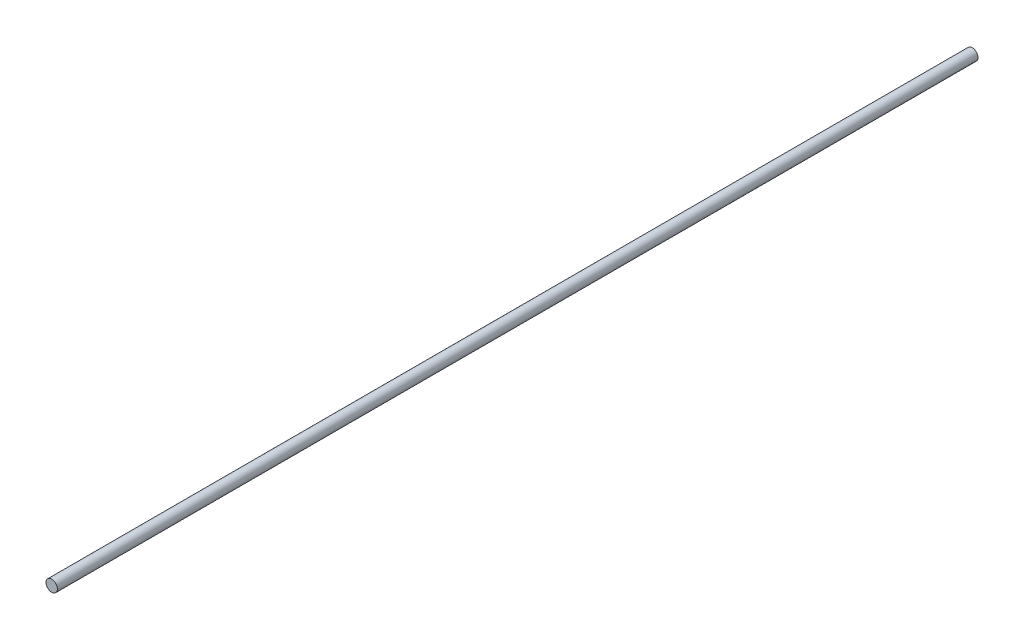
from build123d import *

# Parameters (mm, degrees)
SKETCH1_R           = 30
BOSS_EXTRUDE1_DEPTH = 4850


with BuildPart() as part:
    # Sketch1 → Boss-Extrude1 (new body)
    with BuildSketch(Plane.XY):
        Circle(SKETCH1_R)
    extrude(amount=-BOSS_EXTRUDE1_DEPTH)


solid = part.part
